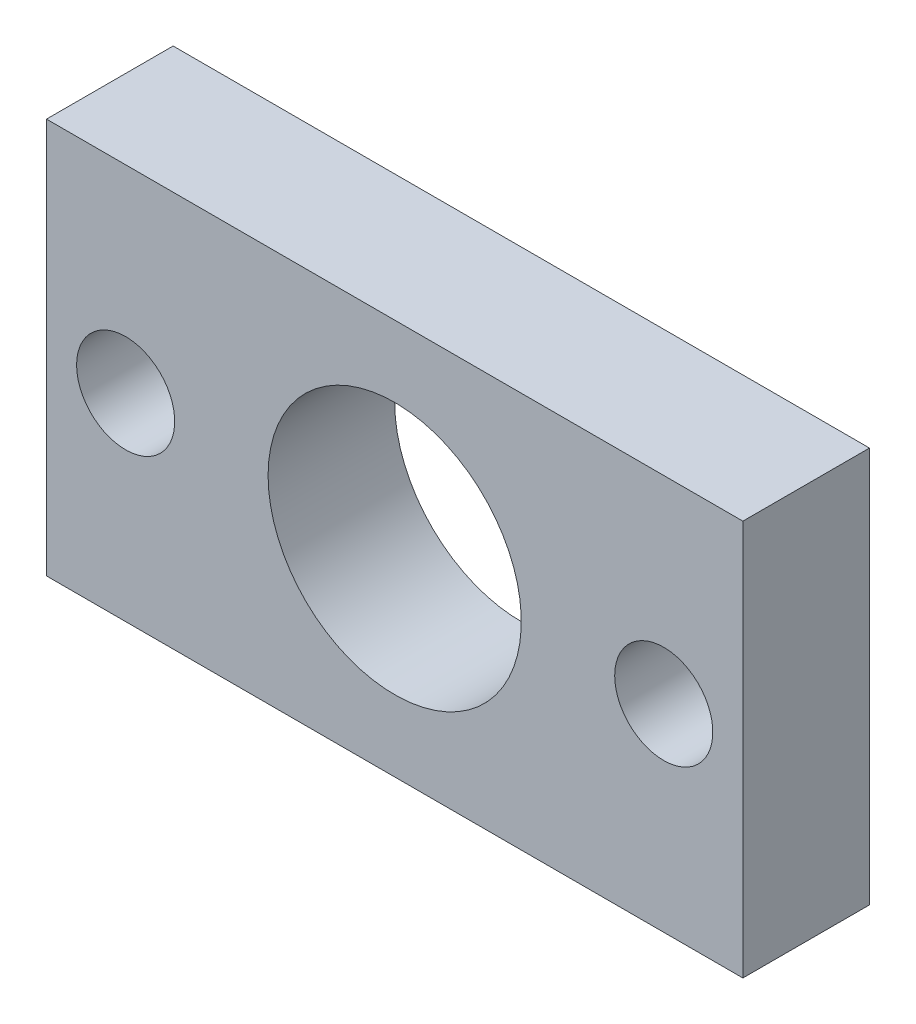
from build123d import *

# Parameters (mm, degrees)
ESQUISSE1_W        = 44
ESQUISSE1_H        = 25
ESQUISSE1_R        = 8
ESQUISSE1_R_2      = 3.1
BOSS_EXTRU_1_DEPTH = 8


with BuildPart() as part:
    # Esquisse1 → Boss.-Extru.1 (new body)
    with BuildSketch(Plane.XY.offset(4)):
        Rectangle(ESQUISSE1_W, ESQUISSE1_H)
        with Locations(Location((0, 0, 0), (0, 0, 180))):
            Circle(ESQUISSE1_R, mode=Mode.SUBTRACT)
        with Locations(Location((-17, 0, 0), (0, 0, 180))):
            Circle(ESQUISSE1_R_2, mode=Mode.SUBTRACT)
        with Locations(Location((17, 0, 0), (0, 0, 180))):
            Circle(ESQUISSE1_R_2, mode=Mode.SUBTRACT)
    extrude(amount=-BOSS_EXTRU_1_DEPTH)


solid = part.part
